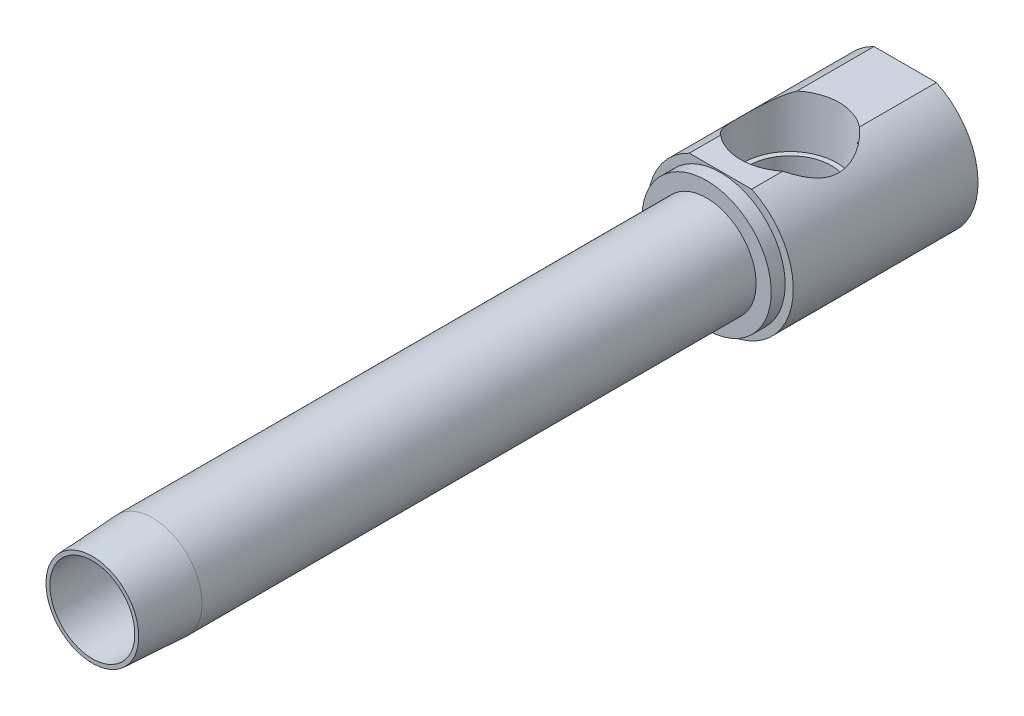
ISO-10303-21;
HEADER;
FILE_DESCRIPTION(('STEP AP214'),'2;1');
FILE_NAME('part.step','',(''),(''),'','','');
FILE_SCHEMA(('AUTOMOTIVE_DESIGN { 1 0 10303 214 1 1 1 1 }'));
ENDSEC;
DATA;
#1=APPLICATION_CONTEXT('core data for automotive mechanical design processes');
#2=APPLICATION_PROTOCOL_DEFINITION('international standard','automotive_design',2000,#1);
#3=PRODUCT_CONTEXT('',#1,'mechanical');
#4=PRODUCT('Part','Part','',(#3));
#5=PRODUCT_RELATED_PRODUCT_CATEGORY('part','',(#4));
#6=PRODUCT_DEFINITION_FORMATION('','',#4);
#7=PRODUCT_DEFINITION_CONTEXT('part definition',#1,'design');
#8=PRODUCT_DEFINITION('design','',#6,#7);
#9=PRODUCT_DEFINITION_SHAPE('','',#8);
#10=(LENGTH_UNIT() NAMED_UNIT(*) SI_UNIT(.MILLI.,.METRE.));
#11=(NAMED_UNIT(*) PLANE_ANGLE_UNIT() SI_UNIT($,.RADIAN.));
#12=(NAMED_UNIT(*) SI_UNIT($,.STERADIAN.) SOLID_ANGLE_UNIT());
#13=UNCERTAINTY_MEASURE_WITH_UNIT(LENGTH_MEASURE(1.E-05),#10,'distance_accuracy_value','');
#14=(GEOMETRIC_REPRESENTATION_CONTEXT(3) GLOBAL_UNCERTAINTY_ASSIGNED_CONTEXT((#13)) GLOBAL_UNIT_ASSIGNED_CONTEXT((#10,
#11,#12)) REPRESENTATION_CONTEXT('',''));
#15=CARTESIAN_POINT('',(0.,0.,0.));
#16=DIRECTION('',(0.,0.,1.));
#17=DIRECTION('',(1.,0.,0.));
#18=AXIS2_PLACEMENT_3D('',#15,#16,#17);
#19=CARTESIAN_POINT('',(-7.29488,0.,0.));
#20=DIRECTION('',(0.,0.,1.));
#21=DIRECTION('',(1.,0.,0.));
#22=AXIS2_PLACEMENT_3D('',#19,#20,#21);
#23=PLANE('',#22);
#24=CARTESIAN_POINT('',(0.,0.,0.));
#25=DIRECTION('',(0.,0.,-1.));
#26=DIRECTION('',(-1.,0.,0.));
#27=AXIS2_PLACEMENT_3D('',#24,#25,#26);
#28=CIRCLE('',#27,7.29488);
#29=CARTESIAN_POINT('',(-7.29488,0.,0.));
#30=VERTEX_POINT('',#29);
#31=EDGE_CURVE('E18',#30,#30,#28,.T.);
#32=ORIENTED_EDGE('',*,*,#31,.T.);
#33=EDGE_LOOP('',(#32));
#34=FACE_BOUND('',#33,.T.);
#35=CARTESIAN_POINT('',(0.,0.,0.));
#36=DIRECTION('',(0.,0.,-1.));
#37=DIRECTION('',(-1.,0.,0.));
#38=AXIS2_PLACEMENT_3D('',#35,#36,#37);
#39=CIRCLE('',#38,7.96721885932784);
#40=CARTESIAN_POINT('',(-7.96721885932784,0.,0.));
#41=VERTEX_POINT('',#40);
#42=EDGE_CURVE('E318',#41,#41,#39,.T.);
#43=ORIENTED_EDGE('',*,*,#42,.F.);
#44=EDGE_LOOP('',(#43));
#45=FACE_BOUND('',#44,.T.);
#46=ADVANCED_FACE('F15',(#34,#45),#23,.T.);
#47=CARTESIAN_POINT('',(0.,0.,-170.447166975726));
#48=DIRECTION('',(0.,0.,-1.));
#49=DIRECTION('',(-1.,0.,0.));
#50=AXIS2_PLACEMENT_3D('',#47,#48,#49);
#51=CYLINDRICAL_SURFACE('',#50,8.509);
#52=CARTESIAN_POINT('',(0.,0.,-10.3378));
#53=DIRECTION('',(0.,0.,-1.));
#54=DIRECTION('',(-1.,0.,0.));
#55=AXIS2_PLACEMENT_3D('',#52,#53,#54);
#56=CIRCLE('',#55,8.509);
#57=CARTESIAN_POINT('',(-8.509,0.,-10.3378));
#58=VERTEX_POINT('',#57);
#59=EDGE_CURVE('E320',#58,#58,#56,.T.);
#60=ORIENTED_EDGE('',*,*,#59,.T.);
#61=EDGE_LOOP('',(#60));
#62=FACE_BOUND('',#61,.T.);
#63=CARTESIAN_POINT('',(0.,0.,-105.5624));
#64=DIRECTION('',(0.,0.,-1.));
#65=DIRECTION('',(-1.,0.,0.));
#66=AXIS2_PLACEMENT_3D('',#63,#64,#65);
#67=CIRCLE('',#66,8.509);
#68=CARTESIAN_POINT('',(-8.509,0.,-105.5624));
#69=VERTEX_POINT('',#68);
#70=EDGE_CURVE('E152',#69,#69,#67,.T.);
#71=ORIENTED_EDGE('',*,*,#70,.F.);
#72=EDGE_LOOP('',(#71));
#73=FACE_BOUND('',#72,.T.);
#74=ADVANCED_FACE('F226',(#62,#73),#51,.T.);
#75=CARTESIAN_POINT('',(-5.3594,11.3032925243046,-95.25));
#76=DIRECTION('',(0.,-1.,0.));
#77=DIRECTION('',(0.,0.,-1.));
#78=AXIS2_PLACEMENT_3D('',#75,#76,#77);
#79=PLANE('',#78);
#80=DIRECTION('',(0.,0.,-1.));
#81=VECTOR('',#80,1.);
#82=CARTESIAN_POINT('',(5.3594,11.3032925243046,-95.25));
#83=LINE('',#82,#81);
#84=CARTESIAN_POINT('',(5.3594,11.3032925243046,-107.95));
#85=VERTEX_POINT('',#84);
#86=CARTESIAN_POINT('',(5.3594,11.3032925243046,-113.30323946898));
#87=VERTEX_POINT('',#86);
#88=EDGE_CURVE('E136',#85,#87,#83,.T.);
#89=ORIENTED_EDGE('',*,*,#88,.T.);
#90=CARTESIAN_POINT('',(0.,11.3032925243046,-119.888));
#91=DIRECTION('',(0.,-1.,0.));
#92=DIRECTION('',(0.,0.,-1.));
#93=AXIS2_PLACEMENT_3D('',#90,#91,#92);
#94=CIRCLE('',#93,8.49012600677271);
#95=CARTESIAN_POINT('',(-5.3594,11.3032925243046,-113.30323946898));
#96=VERTEX_POINT('',#95);
#97=EDGE_CURVE('E122',#87,#96,#94,.T.);
#98=ORIENTED_EDGE('',*,*,#97,.T.);
#99=DIRECTION('',(0.,0.,-1.));
#100=VECTOR('',#99,1.);
#101=CARTESIAN_POINT('',(-5.3594,11.3032925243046,-95.25));
#102=LINE('',#101,#100);
#103=CARTESIAN_POINT('',(-5.3594,11.3032925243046,-107.95));
#104=VERTEX_POINT('',#103);
#105=EDGE_CURVE('E147',#104,#96,#102,.T.);
#106=ORIENTED_EDGE('',*,*,#105,.F.);
#107=DIRECTION('',(1.,0.,0.));
#108=VECTOR('',#107,1.);
#109=CARTESIAN_POINT('',(-11.1125,11.3032925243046,-107.95));
#110=LINE('',#109,#108);
#111=EDGE_CURVE('E144',#104,#85,#110,.T.);
#112=ORIENTED_EDGE('',*,*,#111,.T.);
#113=EDGE_LOOP('',(#89,#98,#106,#112));
#114=FACE_BOUND('',#113,.T.);
#115=ADVANCED_FACE('F142',(#114),#79,.F.);
#116=CARTESIAN_POINT('',(0.,0.,-170.447166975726));
#117=DIRECTION('',(0.,0.,-1.));
#118=DIRECTION('',(-1.,0.,0.));
#119=AXIS2_PLACEMENT_3D('',#116,#117,#118);
#120=CYLINDRICAL_SURFACE('',#119,7.29488);
#121=ORIENTED_EDGE('',*,*,#31,.F.);
#122=EDGE_LOOP('',(#121));
#123=FACE_BOUND('',#122,.T.);
#124=CARTESIAN_POINT('',(0.,0.,-105.41));
#125=DIRECTION('',(0.,0.,-1.));
#126=DIRECTION('',(-1.,0.,0.));
#127=AXIS2_PLACEMENT_3D('',#124,#125,#126);
#128=CIRCLE('',#127,7.29488);
#129=CARTESIAN_POINT('',(-2.83926860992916,-6.71965981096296,-105.41));
#130=VERTEX_POINT('',#129);
#131=CARTESIAN_POINT('',(2.83926860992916,-6.71965981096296,-105.41));
#132=VERTEX_POINT('',#131);
#133=EDGE_CURVE('E166',#130,#132,#128,.T.);
#134=ORIENTED_EDGE('',*,*,#133,.T.);
#135=CARTESIAN_POINT('',(2.83926860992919,-6.71965981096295,-105.41));
#136=CARTESIAN_POINT('',(2.70908587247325,-6.77470567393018,-105.352021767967));
#137=CARTESIAN_POINT('',(2.57545350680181,-6.82667201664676,-105.298915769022));
#138=CARTESIAN_POINT('',(2.30236644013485,-6.92352687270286,-105.202164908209));
#139=CARTESIAN_POINT('',(2.16291320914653,-6.96841715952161,-105.158517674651));
#140=CARTESIAN_POINT('',(1.87942013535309,-7.05016472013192,-105.080434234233));
#141=CARTESIAN_POINT('',(1.7353879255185,-7.08703463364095,-105.045983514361));
#142=CARTESIAN_POINT('',(1.44358277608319,-7.1521803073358,-104.985918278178));
#143=CARTESIAN_POINT('',(1.2958096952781,-7.18045574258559,-104.96030409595));
#144=CARTESIAN_POINT('',(0.997667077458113,-7.22791200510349,-104.917692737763));
#145=CARTESIAN_POINT('',(0.847298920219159,-7.2470975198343,-104.900691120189));
#146=CARTESIAN_POINT('',(0.54494598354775,-7.27608226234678,-104.875120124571));
#147=CARTESIAN_POINT('',(0.392961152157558,-7.28588118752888,-104.86655101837));
#148=CARTESIAN_POINT('',(0.088339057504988,-7.29593786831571,-104.857757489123));
#149=CARTESIAN_POINT('',(-0.0642985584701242,-7.29618956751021,-104.857538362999));
#150=CARTESIAN_POINT('',(-0.369068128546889,-7.28713276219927,-104.865455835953));
#151=CARTESIAN_POINT('',(-0.521200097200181,-7.27782453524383,-104.873592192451));
#152=CARTESIAN_POINT('',(-0.825795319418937,-7.24962203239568,-104.898456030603));
#153=CARTESIAN_POINT('',(-0.978239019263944,-7.23060958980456,-104.915289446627));
#154=CARTESIAN_POINT('',(-1.28042184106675,-7.18325692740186,-104.957772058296));
#155=CARTESIAN_POINT('',(-1.43016107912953,-7.15491710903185,-104.983420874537));
#156=CARTESIAN_POINT('',(-1.72558403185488,-7.0894631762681,-105.043720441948));
#157=CARTESIAN_POINT('',(-1.87127414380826,-7.05236389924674,-105.078355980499));
#158=CARTESIAN_POINT('',(-2.15770494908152,-6.97006186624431,-105.156925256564));
#159=CARTESIAN_POINT('',(-2.29844851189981,-6.92486390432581,-105.200853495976));
#160=CARTESIAN_POINT('',(-2.50498218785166,-6.85169148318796,-105.273911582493));
#161=CARTESIAN_POINT('',(-2.57303323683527,-6.8264174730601,-105.299445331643));
#162=CARTESIAN_POINT('',(-2.70743134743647,-6.77423657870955,-105.352910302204));
#163=CARTESIAN_POINT('',(-2.77378053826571,-6.74733189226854,-105.380838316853));
#164=CARTESIAN_POINT('',(-2.83926860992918,-6.7196598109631,-105.41));
#165=B_SPLINE_CURVE_WITH_KNOTS('',3,(#135,#136,#137,#138,#139,#140,#141,#142,#143,#144,#145,
#146,#147,#148,#149,#150,#151,#152,#153,#154,#155,#156,#157,#158,#159,#160,#161,#162,#163,#164),
.UNSPECIFIED.,.F.,.F.,(4,2,2,2,2,2,2,2,2,2,2,2,2,2,4),(0.,0.458141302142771,0.91616759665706,
1.37346674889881,1.83078318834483,2.28786354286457,2.74495863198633,3.20234368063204,
3.65971545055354,4.12279436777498,4.58585335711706,5.04813354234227,5.51014097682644,
5.74093493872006,5.97142447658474),.UNSPECIFIED.);
#166=EDGE_CURVE('E228',#132,#130,#165,.T.);
#167=ORIENTED_EDGE('',*,*,#166,.T.);
#168=EDGE_LOOP('',(#134,#167));
#169=FACE_BOUND('',#168,.T.);
#170=ADVANCED_FACE('F221',(#123,#169),#120,.F.);
#171=CARTESIAN_POINT('',(-7.29488,0.,-105.41));
#172=DIRECTION('',(0.,0.,1.));
#173=DIRECTION('',(1.,0.,0.));
#174=AXIS2_PLACEMENT_3D('',#171,#172,#173);
#175=PLANE('',#174);
#176=ORIENTED_EDGE('',*,*,#133,.F.);
#177=CARTESIAN_POINT('',(0.,-0.996470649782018,-105.41));
#178=DIRECTION('',(0.,0.,1.));
#179=DIRECTION('',(0.,-1.,0.));
#180=AXIS2_PLACEMENT_3D('',#177,#178,#179);
#181=ELLIPSE('',#180,6.41876281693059,6.27107494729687);
#182=EDGE_CURVE('E170',#130,#132,#181,.F.);
#183=ORIENTED_EDGE('',*,*,#182,.T.);
#184=EDGE_LOOP('',(#176,#183));
#185=FACE_BOUND('',#184,.T.);
#186=ADVANCED_FACE('F217',(#185),#175,.T.);
#187=CARTESIAN_POINT('',(-12.5095,0.,-139.7));
#188=DIRECTION('',(0.,0.,-1.));
#189=DIRECTION('',(-1.,0.,0.));
#190=AXIS2_PLACEMENT_3D('',#187,#188,#189);
#191=PLANE('',#190);
#192=DIRECTION('',(1.,0.,0.));
#193=VECTOR('',#192,1.);
#194=CARTESIAN_POINT('',(-3.66617420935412,6.35,-139.7));
#195=LINE('',#194,#193);
#196=CARTESIAN_POINT('',(-3.66617420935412,6.35,-139.7));
#197=VERTEX_POINT('',#196);
#198=CARTESIAN_POINT('',(3.66617420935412,6.35,-139.7));
#199=VERTEX_POINT('',#198);
#200=EDGE_CURVE('E235',#197,#199,#195,.T.);
#201=ORIENTED_EDGE('',*,*,#200,.F.);
#202=DIRECTION('',(0.5,0.866025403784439,0.));
#203=VECTOR('',#202,1.);
#204=CARTESIAN_POINT('',(-7.33234841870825,0.,-139.7));
#205=LINE('',#204,#203);
#206=CARTESIAN_POINT('',(-7.33234841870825,0.,-139.7));
#207=VERTEX_POINT('',#206);
#208=EDGE_CURVE('E242',#207,#197,#205,.T.);
#209=ORIENTED_EDGE('',*,*,#208,.F.);
#210=DIRECTION('',(-0.5,0.866025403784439,0.));
#211=VECTOR('',#210,1.);
#212=CARTESIAN_POINT('',(-3.66617420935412,-6.35,-139.7));
#213=LINE('',#212,#211);
#214=CARTESIAN_POINT('',(-3.66617420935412,-6.35,-139.7));
#215=VERTEX_POINT('',#214);
#216=EDGE_CURVE('E268',#215,#207,#213,.T.);
#217=ORIENTED_EDGE('',*,*,#216,.F.);
#218=DIRECTION('',(-1.,0.,0.));
#219=VECTOR('',#218,1.);
#220=CARTESIAN_POINT('',(3.66617420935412,-6.35,-139.7));
#221=LINE('',#220,#219);
#222=CARTESIAN_POINT('',(3.66617420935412,-6.35,-139.7));
#223=VERTEX_POINT('',#222);
#224=EDGE_CURVE('E265',#223,#215,#221,.T.);
#225=ORIENTED_EDGE('',*,*,#224,.F.);
#226=DIRECTION('',(-0.5,-0.866025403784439,0.));
#227=VECTOR('',#226,1.);
#228=CARTESIAN_POINT('',(7.33234841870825,0.,-139.7));
#229=LINE('',#228,#227);
#230=CARTESIAN_POINT('',(7.33234841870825,0.,-139.7));
#231=VERTEX_POINT('',#230);
#232=EDGE_CURVE('E262',#231,#223,#229,.T.);
#233=ORIENTED_EDGE('',*,*,#232,.F.);
#234=DIRECTION('',(0.5,-0.866025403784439,0.));
#235=VECTOR('',#234,1.);
#236=CARTESIAN_POINT('',(3.66617420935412,6.35,-139.7));
#237=LINE('',#236,#235);
#238=EDGE_CURVE('E259',#199,#231,#237,.T.);
#239=ORIENTED_EDGE('',*,*,#238,.F.);
#240=EDGE_LOOP('',(#201,#209,#217,#225,#233,#239));
#241=FACE_BOUND('',#240,.T.);
#242=DIRECTION('',(-1.,0.,0.));
#243=VECTOR('',#242,1.);
#244=CARTESIAN_POINT('',(-5.3594,11.3032925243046,-139.7));
#245=LINE('',#244,#243);
#246=CARTESIAN_POINT('',(5.3594,11.3032925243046,-139.7));
#247=VERTEX_POINT('',#246);
#248=CARTESIAN_POINT('',(-5.3594,11.3032925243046,-139.7));
#249=VERTEX_POINT('',#248);
#250=EDGE_CURVE('E149',#247,#249,#245,.T.);
#251=ORIENTED_EDGE('',*,*,#250,.F.);
#252=CARTESIAN_POINT('',(0.,0.,-139.7));
#253=DIRECTION('',(0.,0.,-1.));
#254=DIRECTION('',(-1.,0.,0.));
#255=AXIS2_PLACEMENT_3D('',#252,#253,#254);
#256=CIRCLE('',#255,12.5095);
#257=EDGE_CURVE('E163',#247,#249,#256,.T.);
#258=ORIENTED_EDGE('',*,*,#257,.T.);
#259=EDGE_LOOP('',(#251,#258));
#260=FACE_BOUND('',#259,.T.);
#261=ADVANCED_FACE('F212',(#241,#260),#191,.T.);
#262=CARTESIAN_POINT('',(0.,0.,-170.447166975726));
#263=DIRECTION('',(0.,0.,-1.));
#264=DIRECTION('',(-1.,0.,0.));
#265=AXIS2_PLACEMENT_3D('',#262,#263,#264);
#266=CYLINDRICAL_SURFACE('',#265,12.5095);
#267=CARTESIAN_POINT('',(5.3589781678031,11.3034925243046,-113.302882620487));
#268=CARTESIAN_POINT('',(5.5492136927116,11.2133234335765,-113.463840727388));
#269=CARTESIAN_POINT('',(5.73165431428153,11.1209258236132,-113.632665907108));
#270=CARTESIAN_POINT('',(6.08048620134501,10.9340894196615,-113.985220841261));
#271=CARTESIAN_POINT('',(6.24687354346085,10.8396501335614,-114.16895421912));
#272=CARTESIAN_POINT('',(6.56420314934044,10.6505028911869,-114.551812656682));
#273=CARTESIAN_POINT('',(6.71502345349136,10.5557980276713,-114.751040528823));
#274=CARTESIAN_POINT('',(6.99914257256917,10.3695935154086,-115.162863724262));
#275=CARTESIAN_POINT('',(7.1324444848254,10.2780933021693,-115.375456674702));
#276=CARTESIAN_POINT('',(7.46650834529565,10.0401700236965,-115.964674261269));
#277=CARTESIAN_POINT('',(7.65054804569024,9.89929381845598,-116.353481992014));
#278=CARTESIAN_POINT('',(7.88323238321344,9.71350267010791,-116.959963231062));
#279=CARTESIAN_POINT('',(7.9535071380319,9.65587918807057,-117.165745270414));
#280=CARTESIAN_POINT('',(8.07900681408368,9.55112103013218,-117.584515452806));
#281=CARTESIAN_POINT('',(8.1342346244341,9.50398434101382,-117.797502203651));
#282=CARTESIAN_POINT('',(8.22106638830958,9.42891275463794,-118.194107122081));
#283=CARTESIAN_POINT('',(8.25505388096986,9.39910020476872,-118.376852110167));
#284=CARTESIAN_POINT('',(8.31144289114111,9.34927427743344,-118.745430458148));
#285=CARTESIAN_POINT('',(8.33384667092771,9.32925898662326,-118.931263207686));
#286=CARTESIAN_POINT('',(8.36672861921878,9.29978140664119,-119.304727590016));
#287=CARTESIAN_POINT('',(8.37721265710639,9.29031392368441,-119.49235829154));
#288=CARTESIAN_POINT('',(8.3861052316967,9.28228778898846,-119.868146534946));
#289=CARTESIAN_POINT('',(8.38451351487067,9.28372936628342,-120.056304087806));
#290=CARTESIAN_POINT('',(8.36928475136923,9.29746017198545,-120.431613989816));
#291=CARTESIAN_POINT('',(8.35565497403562,9.30974285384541,-120.61876687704));
#292=CARTESIAN_POINT('',(8.31657917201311,9.3446659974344,-120.990843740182));
#293=CARTESIAN_POINT('',(8.2911332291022,9.36730638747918,-121.175767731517));
#294=CARTESIAN_POINT('',(8.22876601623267,9.42213985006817,-121.542394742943));
#295=CARTESIAN_POINT('',(8.19183425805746,9.45434165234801,-121.724094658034));
#296=CARTESIAN_POINT('',(8.10694730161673,9.52723048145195,-122.083247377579));
#297=CARTESIAN_POINT('',(8.0589858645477,9.56792230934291,-122.26069771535));
#298=CARTESIAN_POINT('',(7.93720028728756,9.66935365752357,-122.660957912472));
#299=CARTESIAN_POINT('',(7.85990590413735,9.73249157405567,-122.882109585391));
#300=CARTESIAN_POINT('',(7.68886075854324,9.86817719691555,-123.314976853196));
#301=CARTESIAN_POINT('',(7.59510436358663,9.94072812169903,-123.526689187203));
#302=CARTESIAN_POINT('',(7.39186656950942,10.092770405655,-123.940230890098));
#303=CARTESIAN_POINT('',(7.28236248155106,10.172271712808,-124.142045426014));
#304=CARTESIAN_POINT('',(7.04849385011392,10.3357003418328,-124.534850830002));
#305=CARTESIAN_POINT('',(6.92413202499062,10.4196268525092,-124.7258436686));
#306=CARTESIAN_POINT('',(6.58695562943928,10.637641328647,-125.201021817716));
#307=CARTESIAN_POINT('',(6.36373226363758,10.7733928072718,-125.477203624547));
#308=CARTESIAN_POINT('',(6.00459360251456,10.9750283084,-125.868460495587));
#309=CARTESIAN_POINT('',(5.88113847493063,11.0417585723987,-125.994781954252));
#310=CARTESIAN_POINT('',(5.62611191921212,11.1738564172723,-126.239769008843));
#311=CARTESIAN_POINT('',(5.49453878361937,11.2392237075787,-126.358432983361));
#312=CARTESIAN_POINT('',(5.3589781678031,11.3034925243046,-126.473117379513));
#313=B_SPLINE_CURVE_WITH_KNOTS('',3,(#267,#268,#269,#270,#271,#272,#273,#274,#275,#276,#277,
#278,#279,#280,#281,#282,#283,#284,#285,#286,#287,#288,#289,#290,#291,#292,#293,#294,#295,#296,
#297,#298,#299,#300,#301,#302,#303,#304,#305,#306,#307,#308,#309,#310,#311,#312),.UNSPECIFIED.,
.F.,.F.,(4,2,2,2,2,2,2,2,2,2,2,2,2,2,2,2,2,2,2,2,2,2,4),(0.,0.794684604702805,1.58956293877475,
2.39025916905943,3.19081364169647,4.54240556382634,5.21661127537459,5.89068744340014,
6.45486541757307,7.01893316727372,7.58272304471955,8.14652475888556,8.70998624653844,
9.2734438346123,9.83741745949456,10.4017108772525,11.128553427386,11.8556451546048,
12.5837951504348,13.3118121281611,14.449296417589,15.0154674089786,15.5817578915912),.UNSPECIFIED.);
#314=CARTESIAN_POINT('',(5.3594,11.3032925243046,-126.47276053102));
#315=VERTEX_POINT('',#314);
#316=EDGE_CURVE('E30',#87,#315,#313,.T.);
#317=ORIENTED_EDGE('',*,*,#316,.F.);
#318=ORIENTED_EDGE('',*,*,#88,.F.);
#319=CARTESIAN_POINT('',(0.,0.,-107.95));
#320=DIRECTION('',(0.,0.,-1.));
#321=DIRECTION('',(-1.,0.,0.));
#322=AXIS2_PLACEMENT_3D('',#319,#320,#321);
#323=CIRCLE('',#322,12.5095);
#324=EDGE_CURVE('E161',#85,#104,#323,.T.);
#325=ORIENTED_EDGE('',*,*,#324,.T.);
#326=ORIENTED_EDGE('',*,*,#105,.T.);
#327=CARTESIAN_POINT('',(-5.3589781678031,11.3034925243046,-126.473117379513));
#328=CARTESIAN_POINT('',(-5.54921369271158,11.2133234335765,-126.312159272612));
#329=CARTESIAN_POINT('',(-5.73165431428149,11.1209258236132,-126.143334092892));
#330=CARTESIAN_POINT('',(-6.08048620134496,10.9340894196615,-125.790779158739));
#331=CARTESIAN_POINT('',(-6.2468735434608,10.8396501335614,-125.60704578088));
#332=CARTESIAN_POINT('',(-6.56420314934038,10.650502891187,-125.224187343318));
#333=CARTESIAN_POINT('',(-6.71502345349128,10.5557980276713,-125.024959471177));
#334=CARTESIAN_POINT('',(-6.99914257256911,10.3695935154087,-124.613136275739));
#335=CARTESIAN_POINT('',(-7.13244448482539,10.2780933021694,-124.400543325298));
#336=CARTESIAN_POINT('',(-7.4665083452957,10.0401700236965,-123.811325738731));
#337=CARTESIAN_POINT('',(-7.65054804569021,9.89929381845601,-123.422518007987));
#338=CARTESIAN_POINT('',(-7.88323238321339,9.71350267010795,-122.816036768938));
#339=CARTESIAN_POINT('',(-7.95350713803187,9.6558791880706,-122.610254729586));
#340=CARTESIAN_POINT('',(-8.07900681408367,9.55112103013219,-122.191484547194));
#341=CARTESIAN_POINT('',(-8.1342346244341,9.50398434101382,-121.978497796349));
#342=CARTESIAN_POINT('',(-8.22106638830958,9.42891275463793,-121.581892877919));
#343=CARTESIAN_POINT('',(-8.25505388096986,9.39910020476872,-121.399147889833));
#344=CARTESIAN_POINT('',(-8.31144289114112,9.34927427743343,-121.030569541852));
#345=CARTESIAN_POINT('',(-8.33384667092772,9.32925898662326,-120.844736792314));
#346=CARTESIAN_POINT('',(-8.36672861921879,9.29978140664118,-120.471272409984));
#347=CARTESIAN_POINT('',(-8.37721265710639,9.29031392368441,-120.28364170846));
#348=CARTESIAN_POINT('',(-8.3861052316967,9.28228778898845,-119.907853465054));
#349=CARTESIAN_POINT('',(-8.38451351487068,9.28372936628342,-119.719695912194));
#350=CARTESIAN_POINT('',(-8.36928475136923,9.29746017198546,-119.344386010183));
#351=CARTESIAN_POINT('',(-8.35565497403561,9.30974285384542,-119.15723312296));
#352=CARTESIAN_POINT('',(-8.31657917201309,9.34466599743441,-118.785156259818));
#353=CARTESIAN_POINT('',(-8.29113322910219,9.36730638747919,-118.600232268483));
#354=CARTESIAN_POINT('',(-8.22876601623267,9.42213985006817,-118.233605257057));
#355=CARTESIAN_POINT('',(-8.19183425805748,9.45434165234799,-118.051905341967));
#356=CARTESIAN_POINT('',(-8.10694730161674,9.52723048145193,-117.692752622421));
#357=CARTESIAN_POINT('',(-8.05898586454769,9.56792230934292,-117.51530228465));
#358=CARTESIAN_POINT('',(-7.93720028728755,9.66935365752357,-117.115042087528));
#359=CARTESIAN_POINT('',(-7.85990590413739,9.73249157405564,-116.89389041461));
#360=CARTESIAN_POINT('',(-7.6888607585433,9.8681771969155,-116.461023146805));
#361=CARTESIAN_POINT('',(-7.59510436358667,9.94072812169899,-116.249310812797));
#362=CARTESIAN_POINT('',(-7.39186656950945,10.0927704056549,-115.835769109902));
#363=CARTESIAN_POINT('',(-7.28236248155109,10.172271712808,-115.633954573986));
#364=CARTESIAN_POINT('',(-7.04849385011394,10.3357003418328,-115.241149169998));
#365=CARTESIAN_POINT('',(-6.92413202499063,10.4196268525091,-115.0501563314));
#366=CARTESIAN_POINT('',(-6.58695562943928,10.637641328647,-114.574978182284));
#367=CARTESIAN_POINT('',(-6.36373226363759,10.7733928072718,-114.298796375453));
#368=CARTESIAN_POINT('',(-6.00459360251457,10.9750283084,-113.907539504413));
#369=CARTESIAN_POINT('',(-5.88113847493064,11.0417585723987,-113.781218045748));
#370=CARTESIAN_POINT('',(-5.62611191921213,11.1738564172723,-113.536230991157));
#371=CARTESIAN_POINT('',(-5.49453878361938,11.2392237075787,-113.417567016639));
#372=CARTESIAN_POINT('',(-5.3589781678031,11.3034925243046,-113.302882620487));
#373=B_SPLINE_CURVE_WITH_KNOTS('',3,(#327,#328,#329,#330,#331,#332,#333,#334,#335,#336,#337,
#338,#339,#340,#341,#342,#343,#344,#345,#346,#347,#348,#349,#350,#351,#352,#353,#354,#355,#356,
#357,#358,#359,#360,#361,#362,#363,#364,#365,#366,#367,#368,#369,#370,#371,#372),.UNSPECIFIED.,
.F.,.F.,(4,2,2,2,2,2,2,2,2,2,2,2,2,2,2,2,2,2,2,2,2,2,4),(0.,0.794684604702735,1.58956293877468,
2.39025916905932,3.1908136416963,4.54240556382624,5.21661127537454,5.89068744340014,
6.45486541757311,7.01893316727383,7.5827230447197,8.14652475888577,8.70998624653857,
9.27344383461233,9.83741745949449,10.4017108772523,11.1285534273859,11.8556451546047,
12.5837951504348,13.3118121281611,14.449296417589,15.0154674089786,15.5817578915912),.UNSPECIFIED.);
#374=CARTESIAN_POINT('',(-5.3594,11.3032925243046,-126.47276053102));
#375=VERTEX_POINT('',#374);
#376=EDGE_CURVE('E125',#375,#96,#373,.T.);
#377=ORIENTED_EDGE('',*,*,#376,.F.);
#378=EDGE_CURVE('E145',#375,#249,#102,.T.);
#379=ORIENTED_EDGE('',*,*,#378,.T.);
#380=ORIENTED_EDGE('',*,*,#257,.F.);
#381=EDGE_CURVE('E139',#315,#247,#83,.T.);
#382=ORIENTED_EDGE('',*,*,#381,.F.);
#383=EDGE_LOOP('',(#317,#318,#325,#326,#377,#379,#380,#382));
#384=FACE_BOUND('',#383,.T.);
#385=ADVANCED_FACE('F134',(#384),#266,.T.);
#386=CARTESIAN_POINT('',(-11.1125,0.,-107.95));
#387=DIRECTION('',(0.,0.,1.));
#388=DIRECTION('',(1.,0.,0.));
#389=AXIS2_PLACEMENT_3D('',#386,#387,#388);
#390=PLANE('',#389);
#391=ORIENTED_EDGE('',*,*,#111,.F.);
#392=ORIENTED_EDGE('',*,*,#324,.F.);
#393=EDGE_LOOP('',(#391,#392));
#394=FACE_BOUND('',#393,.T.);
#395=CARTESIAN_POINT('',(0.,0.,-107.95));
#396=DIRECTION('',(0.,0.,-1.));
#397=DIRECTION('',(-1.,0.,0.));
#398=AXIS2_PLACEMENT_3D('',#395,#396,#397);
#399=CIRCLE('',#398,11.1125);
#400=CARTESIAN_POINT('',(-11.1125,0.,-107.95));
#401=VERTEX_POINT('',#400);
#402=EDGE_CURVE('E158',#401,#401,#399,.T.);
#403=ORIENTED_EDGE('',*,*,#402,.T.);
#404=EDGE_LOOP('',(#403));
#405=FACE_BOUND('',#404,.T.);
#406=ADVANCED_FACE('F211',(#394,#405),#390,.T.);
#407=CARTESIAN_POINT('',(0.,0.,-170.447166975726));
#408=DIRECTION('',(0.,0.,-1.));
#409=DIRECTION('',(-1.,0.,0.));
#410=AXIS2_PLACEMENT_3D('',#407,#408,#409);
#411=CYLINDRICAL_SURFACE('',#410,11.1125);
#412=CARTESIAN_POINT('',(0.,0.,-105.5624));
#413=DIRECTION('',(0.,0.,-1.));
#414=DIRECTION('',(-1.,0.,0.));
#415=AXIS2_PLACEMENT_3D('',#412,#413,#414);
#416=CIRCLE('',#415,11.1125);
#417=CARTESIAN_POINT('',(-11.1125,0.,-105.5624));
#418=VERTEX_POINT('',#417);
#419=EDGE_CURVE('E155',#418,#418,#416,.T.);
#420=ORIENTED_EDGE('',*,*,#419,.T.);
#421=EDGE_LOOP('',(#420));
#422=FACE_BOUND('',#421,.T.);
#423=ORIENTED_EDGE('',*,*,#402,.F.);
#424=EDGE_LOOP('',(#423));
#425=FACE_BOUND('',#424,.T.);
#426=ADVANCED_FACE('F293',(#422,#425),#411,.T.);
#427=CARTESIAN_POINT('',(-8.509,0.,-105.5624));
#428=DIRECTION('',(0.,0.,1.));
#429=DIRECTION('',(1.,0.,0.));
#430=AXIS2_PLACEMENT_3D('',#427,#428,#429);
#431=PLANE('',#430);
#432=ORIENTED_EDGE('',*,*,#70,.T.);
#433=EDGE_LOOP('',(#432));
#434=FACE_BOUND('',#433,.T.);
#435=ORIENTED_EDGE('',*,*,#419,.F.);
#436=EDGE_LOOP('',(#435));
#437=FACE_BOUND('',#436,.T.);
#438=ADVANCED_FACE('F297',(#434,#437),#431,.T.);
#439=ORIENTED_EDGE('',*,*,#378,.F.);
#440=EDGE_CURVE('E129',#375,#315,#94,.T.);
#441=ORIENTED_EDGE('',*,*,#440,.T.);
#442=ORIENTED_EDGE('',*,*,#381,.T.);
#443=ORIENTED_EDGE('',*,*,#250,.T.);
#444=EDGE_LOOP('',(#439,#441,#442,#443));
#445=FACE_BOUND('',#444,.T.);
#446=ADVANCED_FACE('F288',(#445),#79,.F.);
#447=CARTESIAN_POINT('',(-3.66617420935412,6.35,-133.35));
#448=DIRECTION('',(0.,1.,0.));
#449=DIRECTION('',(-1.,0.,0.));
#450=AXIS2_PLACEMENT_3D('',#447,#448,#449);
#451=PLANE('',#450);
#452=ORIENTED_EDGE('',*,*,#200,.T.);
#453=DIRECTION('',(0.,0.,-1.));
#454=VECTOR('',#453,1.);
#455=CARTESIAN_POINT('',(3.66617420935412,6.35,-133.35));
#456=LINE('',#455,#454);
#457=CARTESIAN_POINT('',(3.66617420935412,6.35,-133.35));
#458=VERTEX_POINT('',#457);
#459=EDGE_CURVE('E257',#458,#199,#456,.T.);
#460=ORIENTED_EDGE('',*,*,#459,.F.);
#461=DIRECTION('',(1.,0.,0.));
#462=VECTOR('',#461,1.);
#463=CARTESIAN_POINT('',(-3.66617420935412,6.35,-133.35));
#464=LINE('',#463,#462);
#465=CARTESIAN_POINT('',(-3.66617420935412,6.35,-133.35));
#466=VERTEX_POINT('',#465);
#467=EDGE_CURVE('E238',#466,#458,#464,.T.);
#468=ORIENTED_EDGE('',*,*,#467,.F.);
#469=DIRECTION('',(0.,0.,-1.));
#470=VECTOR('',#469,1.);
#471=CARTESIAN_POINT('',(-3.66617420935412,6.35,-133.35));
#472=LINE('',#471,#470);
#473=EDGE_CURVE('E273',#466,#197,#472,.T.);
#474=ORIENTED_EDGE('',*,*,#473,.T.);
#475=EDGE_LOOP('',(#452,#460,#468,#474));
#476=FACE_BOUND('',#475,.T.);
#477=ADVANCED_FACE('F392',(#476),#451,.F.);
#478=CARTESIAN_POINT('',(-7.33234841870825,0.,-133.35));
#479=DIRECTION('',(-0.866025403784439,0.5,0.));
#480=DIRECTION('',(-0.5,-0.866025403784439,0.));
#481=AXIS2_PLACEMENT_3D('',#478,#479,#480);
#482=PLANE('',#481);
#483=ORIENTED_EDGE('',*,*,#208,.T.);
#484=ORIENTED_EDGE('',*,*,#473,.F.);
#485=DIRECTION('',(0.5,0.866025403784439,0.));
#486=VECTOR('',#485,1.);
#487=CARTESIAN_POINT('',(-7.33234841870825,0.,-133.35));
#488=LINE('',#487,#486);
#489=CARTESIAN_POINT('',(-7.33234841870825,0.,-133.35));
#490=VERTEX_POINT('',#489);
#491=EDGE_CURVE('E254',#490,#466,#488,.T.);
#492=ORIENTED_EDGE('',*,*,#491,.F.);
#493=DIRECTION('',(0.,0.,-1.));
#494=VECTOR('',#493,1.);
#495=CARTESIAN_POINT('',(-7.33234841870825,0.,-133.35));
#496=LINE('',#495,#494);
#497=EDGE_CURVE('E275',#490,#207,#496,.T.);
#498=ORIENTED_EDGE('',*,*,#497,.T.);
#499=EDGE_LOOP('',(#483,#484,#492,#498));
#500=FACE_BOUND('',#499,.T.);
#501=ADVANCED_FACE('F388',(#500),#482,.F.);
#502=CARTESIAN_POINT('',(-3.66617420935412,-6.35,-133.35));
#503=DIRECTION('',(-0.866025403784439,-0.5,0.));
#504=DIRECTION('',(0.5,-0.866025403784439,0.));
#505=AXIS2_PLACEMENT_3D('',#502,#503,#504);
#506=PLANE('',#505);
#507=ORIENTED_EDGE('',*,*,#216,.T.);
#508=ORIENTED_EDGE('',*,*,#497,.F.);
#509=DIRECTION('',(-0.5,0.866025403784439,0.));
#510=VECTOR('',#509,1.);
#511=CARTESIAN_POINT('',(-3.66617420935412,-6.35,-133.35));
#512=LINE('',#511,#510);
#513=CARTESIAN_POINT('',(-3.66617420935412,-6.35,-133.35));
#514=VERTEX_POINT('',#513);
#515=EDGE_CURVE('E251',#514,#490,#512,.T.);
#516=ORIENTED_EDGE('',*,*,#515,.F.);
#517=DIRECTION('',(0.,0.,-1.));
#518=VECTOR('',#517,1.);
#519=CARTESIAN_POINT('',(-3.66617420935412,-6.35,-133.35));
#520=LINE('',#519,#518);
#521=EDGE_CURVE('E277',#514,#215,#520,.T.);
#522=ORIENTED_EDGE('',*,*,#521,.T.);
#523=EDGE_LOOP('',(#507,#508,#516,#522));
#524=FACE_BOUND('',#523,.T.);
#525=ADVANCED_FACE('F391',(#524),#506,.F.);
#526=CARTESIAN_POINT('',(3.66617420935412,-6.35,-133.35));
#527=DIRECTION('',(0.,-1.,0.));
#528=DIRECTION('',(1.,0.,0.));
#529=AXIS2_PLACEMENT_3D('',#526,#527,#528);
#530=PLANE('',#529);
#531=ORIENTED_EDGE('',*,*,#224,.T.);
#532=ORIENTED_EDGE('',*,*,#521,.F.);
#533=DIRECTION('',(-1.,0.,0.));
#534=VECTOR('',#533,1.);
#535=CARTESIAN_POINT('',(3.66617420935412,-6.35,-133.35));
#536=LINE('',#535,#534);
#537=CARTESIAN_POINT('',(3.66617420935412,-6.35,-133.35));
#538=VERTEX_POINT('',#537);
#539=EDGE_CURVE('E248',#538,#514,#536,.T.);
#540=ORIENTED_EDGE('',*,*,#539,.F.);
#541=DIRECTION('',(0.,0.,-1.));
#542=VECTOR('',#541,1.);
#543=CARTESIAN_POINT('',(3.66617420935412,-6.35,-133.35));
#544=LINE('',#543,#542);
#545=EDGE_CURVE('E279',#538,#223,#544,.T.);
#546=ORIENTED_EDGE('',*,*,#545,.T.);
#547=EDGE_LOOP('',(#531,#532,#540,#546));
#548=FACE_BOUND('',#547,.T.);
#549=ADVANCED_FACE('F396',(#548),#530,.F.);
#550=CARTESIAN_POINT('',(7.33234841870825,0.,-133.35));
#551=DIRECTION('',(0.866025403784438,-0.5,0.));
#552=DIRECTION('',(0.5,0.866025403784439,0.));
#553=AXIS2_PLACEMENT_3D('',#550,#551,#552);
#554=PLANE('',#553);
#555=ORIENTED_EDGE('',*,*,#232,.T.);
#556=ORIENTED_EDGE('',*,*,#545,.F.);
#557=DIRECTION('',(-0.5,-0.866025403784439,0.));
#558=VECTOR('',#557,1.);
#559=CARTESIAN_POINT('',(7.33234841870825,0.,-133.35));
#560=LINE('',#559,#558);
#561=CARTESIAN_POINT('',(7.33234841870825,0.,-133.35));
#562=VERTEX_POINT('',#561);
#563=EDGE_CURVE('E245',#562,#538,#560,.T.);
#564=ORIENTED_EDGE('',*,*,#563,.F.);
#565=DIRECTION('',(0.,0.,-1.));
#566=VECTOR('',#565,1.);
#567=CARTESIAN_POINT('',(7.33234841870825,0.,-133.35));
#568=LINE('',#567,#566);
#569=EDGE_CURVE('E281',#562,#231,#568,.T.);
#570=ORIENTED_EDGE('',*,*,#569,.T.);
#571=EDGE_LOOP('',(#555,#556,#564,#570));
#572=FACE_BOUND('',#571,.T.);
#573=ADVANCED_FACE('F400',(#572),#554,.F.);
#574=CARTESIAN_POINT('',(3.66617420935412,6.35,-133.35));
#575=DIRECTION('',(0.866025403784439,0.5,0.));
#576=DIRECTION('',(-0.5,0.866025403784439,0.));
#577=AXIS2_PLACEMENT_3D('',#574,#575,#576);
#578=PLANE('',#577);
#579=ORIENTED_EDGE('',*,*,#238,.T.);
#580=ORIENTED_EDGE('',*,*,#569,.F.);
#581=DIRECTION('',(0.5,-0.866025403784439,0.));
#582=VECTOR('',#581,1.);
#583=CARTESIAN_POINT('',(3.66617420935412,6.35,-133.35));
#584=LINE('',#583,#582);
#585=EDGE_CURVE('E241',#458,#562,#584,.T.);
#586=ORIENTED_EDGE('',*,*,#585,.F.);
#587=ORIENTED_EDGE('',*,*,#459,.T.);
#588=EDGE_LOOP('',(#579,#580,#586,#587));
#589=FACE_BOUND('',#588,.T.);
#590=ADVANCED_FACE('F386',(#589),#578,.F.);
#591=CARTESIAN_POINT('',(0.,0.,-133.35));
#592=DIRECTION('',(0.,0.,-1.));
#593=DIRECTION('',(-1.,0.,0.));
#594=AXIS2_PLACEMENT_3D('',#591,#592,#593);
#595=PLANE('',#594);
#596=ORIENTED_EDGE('',*,*,#467,.T.);
#597=ORIENTED_EDGE('',*,*,#585,.T.);
#598=ORIENTED_EDGE('',*,*,#563,.T.);
#599=ORIENTED_EDGE('',*,*,#539,.T.);
#600=ORIENTED_EDGE('',*,*,#515,.T.);
#601=ORIENTED_EDGE('',*,*,#491,.T.);
#602=EDGE_LOOP('',(#596,#597,#598,#599,#600,#601));
#603=FACE_BOUND('',#602,.T.);
#604=ADVANCED_FACE('F381',(#603),#595,.T.);
#605=CARTESIAN_POINT('',(0.,-4.02688128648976,-119.291711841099));
#606=DIRECTION('',(0.,0.213279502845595,0.976991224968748));
#607=DIRECTION('',(0.,-0.976991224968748,0.213279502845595));
#608=AXIS2_PLACEMENT_3D('',#605,#606,#607);
#609=CONICAL_SURFACE('',#608,6.27107494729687,0.738529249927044);
#610=CARTESIAN_POINT('',(0.,-7.8171617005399,-122.001165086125));
#611=CARTESIAN_POINT('',(0.0306488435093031,-7.81716198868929,-122.001165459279));
#612=CARTESIAN_POINT('',(0.0612977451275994,-7.81694149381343,-122.000879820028));
#613=CARTESIAN_POINT('',(0.129766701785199,-7.81595747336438,-121.999605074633));
#614=CARTESIAN_POINT('',(0.16758240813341,-7.81507869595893,-121.998466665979));
#615=CARTESIAN_POINT('',(0.243722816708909,-7.81263621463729,-121.995302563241));
#616=CARTESIAN_POINT('',(0.28204666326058,-7.81106245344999,-121.993263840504));
#617=CARTESIAN_POINT('',(0.338345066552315,-7.80824831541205,-121.989618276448));
#618=CARTESIAN_POINT('',(0.356356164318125,-7.80727222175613,-121.988353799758));
#619=CARTESIAN_POINT('',(0.446379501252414,-7.8020163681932,-121.981545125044));
#620=CARTESIAN_POINT('',(0.518221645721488,-7.79661392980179,-121.974546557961));
#621=CARTESIAN_POINT('',(0.733733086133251,-7.77685263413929,-121.948946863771));
#622=CARTESIAN_POINT('',(0.87656324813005,-7.75896145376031,-121.92576979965));
#623=CARTESIAN_POINT('',(1.15867598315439,-7.71482779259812,-121.868597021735));
#624=CARTESIAN_POINT('',(1.29795748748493,-7.68858282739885,-121.834598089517));
#625=CARTESIAN_POINT('',(1.6188631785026,-7.6188762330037,-121.744296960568));
#626=CARTESIAN_POINT('',(1.79884032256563,-7.57259419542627,-121.684341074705));
#627=CARTESIAN_POINT('',(2.15114857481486,-7.47011058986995,-121.551579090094));
#628=CARTESIAN_POINT('',(2.32347015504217,-7.41389707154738,-121.478757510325));
#629=CARTESIAN_POINT('',(2.66304496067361,-7.29317142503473,-121.322363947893));
#630=CARTESIAN_POINT('',(2.8302045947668,-7.22856193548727,-121.238665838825));
#631=CARTESIAN_POINT('',(3.07597005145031,-7.12727098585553,-121.107448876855));
#632=CARTESIAN_POINT('',(3.15704408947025,-7.09278664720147,-121.062776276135));
#633=CARTESIAN_POINT('',(3.31767893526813,-7.02252656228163,-120.971758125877));
#634=CARTESIAN_POINT('',(3.39723977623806,-6.98675084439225,-120.925412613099));
#635=CARTESIAN_POINT('',(3.62832422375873,-6.8802648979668,-120.787465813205));
#636=CARTESIAN_POINT('',(3.77794772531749,-6.80801352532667,-120.693868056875));
#637=CARTESIAN_POINT('',(4.07276390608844,-6.66019905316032,-120.50238238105));
#638=CARTESIAN_POINT('',(4.21795568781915,-6.58463529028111,-120.404493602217));
#639=CARTESIAN_POINT('',(4.50463813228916,-6.43081711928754,-120.205230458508));
#640=CARTESIAN_POINT('',(4.64612614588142,-6.35256087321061,-120.10385371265));
#641=CARTESIAN_POINT('',(4.92585635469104,-6.19390612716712,-119.89832504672));
#642=CARTESIAN_POINT('',(5.06409831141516,-6.11350747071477,-119.794172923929));
#643=CARTESIAN_POINT('',(5.3383026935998,-5.95065173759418,-119.583202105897));
#644=CARTESIAN_POINT('',(5.47425459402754,-5.86818805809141,-119.476374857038));
#645=CARTESIAN_POINT('',(5.74373112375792,-5.70179106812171,-119.260816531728));
#646=CARTESIAN_POINT('',(5.87725566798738,-5.61785770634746,-119.152085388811));
#647=CARTESIAN_POINT('',(6.27471014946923,-5.36420563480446,-118.823492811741));
#648=CARTESIAN_POINT('',(6.53550012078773,-5.1926474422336,-118.601248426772));
#649=CARTESIAN_POINT('',(6.90967614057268,-4.94086927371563,-118.275083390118));
#650=CARTESIAN_POINT('',(7.02561522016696,-4.86205133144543,-118.172978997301));
#651=CARTESIAN_POINT('',(7.25630735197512,-4.70377895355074,-117.96794566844));
#652=CARTESIAN_POINT('',(7.37106048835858,-4.62432456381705,-117.865016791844));
#653=CARTESIAN_POINT('',(7.71377734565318,-4.38509712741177,-117.555110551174));
#654=CARTESIAN_POINT('',(7.94016627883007,-4.2244815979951,-117.347041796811));
#655=CARTESIAN_POINT('',(8.38754778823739,-3.90293226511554,-116.930491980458));
#656=CARTESIAN_POINT('',(8.60857047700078,-3.74201405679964,-116.722031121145));
#657=CARTESIAN_POINT('',(9.04780163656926,-3.41880327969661,-116.303328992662));
#658=CARTESIAN_POINT('',(9.26601066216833,-3.256510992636,-116.093088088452));
#659=CARTESIAN_POINT('',(9.48311661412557,-3.09367537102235,-115.882143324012));
#660=B_SPLINE_CURVE_WITH_KNOTS('',3,(#610,#611,#612,#613,#614,#615,#616,#617,#618,#619,#620,
#621,#622,#623,#624,#625,#626,#627,#628,#629,#630,#631,#632,#633,#634,#635,#636,#637,#638,#639,
#640,#641,#642,#643,#644,#645,#646,#647,#648,#649,#650,#651,#652,#653,#654,#655,#656,#657,#658,
#659),.UNSPECIFIED.,.F.,.F.,(4,2,2,2,2,2,2,2,2,2,2,2,2,2,2,2,2,2,2,2,2,2,2,2,4),(0.,
0.0919447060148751,0.20545801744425,0.320670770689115,0.374915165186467,0.591966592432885,
1.02853093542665,1.46522523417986,2.04991564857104,2.63531446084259,3.22823618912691,
3.52455545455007,3.82086821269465,4.39280368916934,4.96485423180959,5.53730333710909,
6.10979437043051,6.68443789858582,7.25910152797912,8.40851631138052,8.92881630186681,
9.44907910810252,10.4897488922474,11.5211435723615,12.5523316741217),.UNSPECIFIED.);
#661=CARTESIAN_POINT('',(0.,-7.8171617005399,-122.001165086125));
#662=VERTEX_POINT('',#661);
#663=CARTESIAN_POINT('',(6.0919781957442,-5.48065691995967,-118.974349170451));
#664=VERTEX_POINT('',#663);
#665=EDGE_CURVE('E373',#662,#664,#660,.T.);
#666=ORIENTED_EDGE('',*,*,#665,.F.);
#667=CARTESIAN_POINT('',(0.,-7.8171617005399,-122.001165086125));
#668=CARTESIAN_POINT('',(-0.0306488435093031,-7.81716198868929,-122.001165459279));
#669=CARTESIAN_POINT('',(-0.0612977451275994,-7.81694149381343,-122.000879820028));
#670=CARTESIAN_POINT('',(-0.129766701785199,-7.81595747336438,-121.999605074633));
#671=CARTESIAN_POINT('',(-0.16758240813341,-7.81507869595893,-121.998466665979));
#672=CARTESIAN_POINT('',(-0.243722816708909,-7.81263621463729,-121.995302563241));
#673=CARTESIAN_POINT('',(-0.28204666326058,-7.81106245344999,-121.993263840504));
#674=CARTESIAN_POINT('',(-0.338345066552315,-7.80824831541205,-121.989618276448));
#675=CARTESIAN_POINT('',(-0.356356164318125,-7.80727222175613,-121.988353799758));
#676=CARTESIAN_POINT('',(-0.446379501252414,-7.8020163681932,-121.981545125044));
#677=CARTESIAN_POINT('',(-0.518221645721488,-7.79661392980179,-121.974546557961));
#678=CARTESIAN_POINT('',(-0.733733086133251,-7.77685263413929,-121.948946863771));
#679=CARTESIAN_POINT('',(-0.87656324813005,-7.75896145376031,-121.92576979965));
#680=CARTESIAN_POINT('',(-1.15867598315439,-7.71482779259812,-121.868597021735));
#681=CARTESIAN_POINT('',(-1.29795748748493,-7.68858282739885,-121.834598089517));
#682=CARTESIAN_POINT('',(-1.6188631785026,-7.6188762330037,-121.744296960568));
#683=CARTESIAN_POINT('',(-1.79884032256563,-7.57259419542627,-121.684341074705));
#684=CARTESIAN_POINT('',(-2.15114857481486,-7.47011058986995,-121.551579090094));
#685=CARTESIAN_POINT('',(-2.32347015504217,-7.41389707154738,-121.478757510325));
#686=CARTESIAN_POINT('',(-2.66304496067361,-7.29317142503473,-121.322363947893));
#687=CARTESIAN_POINT('',(-2.8302045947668,-7.22856193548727,-121.238665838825));
#688=CARTESIAN_POINT('',(-3.07597005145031,-7.12727098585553,-121.107448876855));
#689=CARTESIAN_POINT('',(-3.15704408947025,-7.09278664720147,-121.062776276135));
#690=CARTESIAN_POINT('',(-3.31767893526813,-7.02252656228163,-120.971758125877));
#691=CARTESIAN_POINT('',(-3.39723977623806,-6.98675084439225,-120.925412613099));
#692=CARTESIAN_POINT('',(-3.62832422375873,-6.8802648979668,-120.787465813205));
#693=CARTESIAN_POINT('',(-3.77794772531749,-6.80801352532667,-120.693868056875));
#694=CARTESIAN_POINT('',(-4.07276390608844,-6.66019905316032,-120.50238238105));
#695=CARTESIAN_POINT('',(-4.21795568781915,-6.58463529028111,-120.404493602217));
#696=CARTESIAN_POINT('',(-4.50463813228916,-6.43081711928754,-120.205230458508));
#697=CARTESIAN_POINT('',(-4.64612614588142,-6.35256087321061,-120.10385371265));
#698=CARTESIAN_POINT('',(-4.92585635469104,-6.19390612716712,-119.89832504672));
#699=CARTESIAN_POINT('',(-5.06409831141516,-6.11350747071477,-119.794172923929));
#700=CARTESIAN_POINT('',(-5.3383026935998,-5.95065173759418,-119.583202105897));
#701=CARTESIAN_POINT('',(-5.47425459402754,-5.86818805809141,-119.476374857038));
#702=CARTESIAN_POINT('',(-5.74373112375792,-5.70179106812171,-119.260816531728));
#703=CARTESIAN_POINT('',(-5.87725566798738,-5.61785770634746,-119.152085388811));
#704=CARTESIAN_POINT('',(-6.27471014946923,-5.36420563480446,-118.823492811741));
#705=CARTESIAN_POINT('',(-6.53550012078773,-5.1926474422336,-118.601248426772));
#706=CARTESIAN_POINT('',(-6.90967614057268,-4.94086927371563,-118.275083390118));
#707=CARTESIAN_POINT('',(-7.02561522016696,-4.86205133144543,-118.172978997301));
#708=CARTESIAN_POINT('',(-7.25630735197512,-4.70377895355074,-117.96794566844));
#709=CARTESIAN_POINT('',(-7.37106048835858,-4.62432456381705,-117.865016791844));
#710=CARTESIAN_POINT('',(-7.71377734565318,-4.38509712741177,-117.555110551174));
#711=CARTESIAN_POINT('',(-7.94016627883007,-4.2244815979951,-117.347041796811));
#712=CARTESIAN_POINT('',(-8.38754778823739,-3.90293226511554,-116.930491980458));
#713=CARTESIAN_POINT('',(-8.60857047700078,-3.74201405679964,-116.722031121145));
#714=CARTESIAN_POINT('',(-9.04780163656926,-3.41880327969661,-116.303328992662));
#715=CARTESIAN_POINT('',(-9.26601066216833,-3.256510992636,-116.093088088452));
#716=CARTESIAN_POINT('',(-9.48311661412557,-3.09367537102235,-115.882143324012));
#717=B_SPLINE_CURVE_WITH_KNOTS('',3,(#667,#668,#669,#670,#671,#672,#673,#674,#675,#676,#677,
#678,#679,#680,#681,#682,#683,#684,#685,#686,#687,#688,#689,#690,#691,#692,#693,#694,#695,#696,
#697,#698,#699,#700,#701,#702,#703,#704,#705,#706,#707,#708,#709,#710,#711,#712,#713,#714,#715,
#716),.UNSPECIFIED.,.F.,.F.,(4,2,2,2,2,2,2,2,2,2,2,2,2,2,2,2,2,2,2,2,2,2,2,2,4),(0.,
0.0919447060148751,0.20545801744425,0.320670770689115,0.374915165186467,0.591966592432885,
1.02853093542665,1.46522523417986,2.04991564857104,2.63531446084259,3.22823618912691,
3.52455545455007,3.82086821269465,4.39280368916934,4.96485423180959,5.53730333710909,
6.10979437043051,6.68443789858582,7.25910152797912,8.40851631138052,8.92881630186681,
9.44907910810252,10.4897488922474,11.5211435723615,12.5523316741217),.UNSPECIFIED.);
#718=CARTESIAN_POINT('',(-6.09197819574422,-5.48065691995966,-118.974349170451));
#719=VERTEX_POINT('',#718);
#720=EDGE_CURVE('E140',#719,#662,#717,.F.);
#721=ORIENTED_EDGE('',*,*,#720,.F.);
#722=CARTESIAN_POINT('',(0.,-4.02688128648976,-119.291711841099));
#723=DIRECTION('',(0.,-0.213279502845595,-0.976991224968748));
#724=DIRECTION('',(0.,0.976991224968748,-0.213279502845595));
#725=AXIS2_PLACEMENT_3D('',#722,#723,#724);
#726=CIRCLE('',#725,6.27107494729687);
#727=EDGE_CURVE('E236',#664,#719,#726,.T.);
#728=ORIENTED_EDGE('',*,*,#727,.F.);
#729=EDGE_LOOP('',(#666,#721,#728));
#730=FACE_BOUND('',#729,.T.);
#731=ADVANCED_FACE('F377',(#730),#609,.F.);
#732=CARTESIAN_POINT('',(0.,-5.49601282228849,-126.021512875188));
#733=DIRECTION('',(0.,-0.213279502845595,-0.976991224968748));
#734=DIRECTION('',(0.,0.976991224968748,-0.213279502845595));
#735=AXIS2_PLACEMENT_3D('',#732,#733,#734);
#736=CYLINDRICAL_SURFACE('',#735,6.27107494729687);
#737=CARTESIAN_POINT('',(6.1733996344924,-5.4473725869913,-120.629403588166));
#738=CARTESIAN_POINT('',(6.16556245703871,-5.46156946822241,-120.488708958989));
#739=CARTESIAN_POINT('',(6.15770208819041,-5.47308176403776,-120.347728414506));
#740=CARTESIAN_POINT('',(6.14232757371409,-5.4903692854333,-120.065371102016));
#741=CARTESIAN_POINT('',(6.13481349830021,-5.4961433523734,-119.923994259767));
#742=CARTESIAN_POINT('',(6.12053666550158,-5.50157705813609,-119.641255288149));
#743=CARTESIAN_POINT('',(6.11377297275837,-5.50124439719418,-119.499893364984));
#744=CARTESIAN_POINT('',(6.10130458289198,-5.49432900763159,-119.217296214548));
#745=CARTESIAN_POINT('',(6.09559978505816,-5.48774687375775,-119.076060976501));
#746=CARTESIAN_POINT('',(6.08061165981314,-5.45889331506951,-118.657195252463));
#747=CARTESIAN_POINT('',(6.07322064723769,-5.42759803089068,-118.38007326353));
#748=CARTESIAN_POINT('',(6.0641492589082,-5.34298500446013,-117.829231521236));
#749=CARTESIAN_POINT('',(6.06246861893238,-5.2896682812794,-117.555511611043));
#750=CARTESIAN_POINT('',(6.06351201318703,-5.20525205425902,-117.187424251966));
#751=CARTESIAN_POINT('',(6.06409521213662,-5.18198291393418,-117.091171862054));
#752=CARTESIAN_POINT('',(6.06581815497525,-5.13337299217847,-116.899214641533));
#753=CARTESIAN_POINT('',(6.06695777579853,-5.10803266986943,-116.803509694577));
#754=CARTESIAN_POINT('',(6.06974140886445,-5.05531295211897,-116.612089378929));
#755=CARTESIAN_POINT('',(6.07138824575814,-5.02792280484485,-116.516377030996));
#756=CARTESIAN_POINT('',(6.07511895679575,-4.97140456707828,-116.325462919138));
#757=CARTESIAN_POINT('',(6.0772028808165,-4.94227627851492,-116.230261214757));
#758=CARTESIAN_POINT('',(6.0794725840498,-4.91236883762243,-116.13531253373));
#759=B_SPLINE_CURVE_WITH_KNOTS('',3,(#737,#738,#739,#740,#741,#742,#743,#744,#745,#746,#747,
#748,#749,#750,#751,#752,#753,#754,#755,#756,#757,#758),.UNSPECIFIED.,.F.,.F.,(4,2,2,2,2,2,2,2,
2,2,4),(0.,0.424876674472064,0.849839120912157,1.27426575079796,1.69865199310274,
2.5344572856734,3.37022390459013,3.66729136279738,3.96429314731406,4.26297977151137,
4.56170049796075),.UNSPECIFIED.);
#760=CARTESIAN_POINT('',(6.07945740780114,-4.91256883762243,-116.135947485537));
#761=VERTEX_POINT('',#760);
#762=EDGE_CURVE('E10',#664,#761,#759,.T.);
#763=ORIENTED_EDGE('',*,*,#762,.F.);
#764=ORIENTED_EDGE('',*,*,#727,.T.);
#765=CARTESIAN_POINT('',(-6.0794725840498,-4.91236883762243,-116.13531253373));
#766=CARTESIAN_POINT('',(-6.07573596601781,-4.96156959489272,-116.291534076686));
#767=CARTESIAN_POINT('',(-6.07250567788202,-5.00867685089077,-116.448458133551));
#768=CARTESIAN_POINT('',(-6.06733933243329,-5.09790632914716,-116.763831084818));
#769=CARTESIAN_POINT('',(-6.06540402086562,-5.14002566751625,-116.92228080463));
#770=CARTESIAN_POINT('',(-6.06311126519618,-5.21852158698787,-117.241046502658));
#771=CARTESIAN_POINT('',(-6.06275781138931,-5.25488342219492,-117.401366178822));
#772=CARTESIAN_POINT('',(-6.06387215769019,-5.32085768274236,-117.723361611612));
#773=CARTESIAN_POINT('',(-6.06533960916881,-5.3504713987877,-117.88503710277));
#774=CARTESIAN_POINT('',(-6.07017346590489,-5.40162696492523,-118.206200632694));
#775=CARTESIAN_POINT('',(-6.07349982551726,-5.42332359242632,-118.365664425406));
#776=CARTESIAN_POINT('',(-6.08199666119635,-5.4589193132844,-118.685429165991));
#777=CARTESIAN_POINT('',(-6.08716726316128,-5.4728178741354,-118.845730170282));
#778=CARTESIAN_POINT('',(-6.09913989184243,-5.49250235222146,-119.166522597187));
#779=CARTESIAN_POINT('',(-6.10593942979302,-5.49830055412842,-119.327013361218));
#780=CARTESIAN_POINT('',(-6.12079517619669,-5.5018556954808,-119.648002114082));
#781=CARTESIAN_POINT('',(-6.1288511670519,-5.49961402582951,-119.808500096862));
#782=CARTESIAN_POINT('',(-6.14017047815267,-5.49144391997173,-120.023873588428));
#783=CARTESIAN_POINT('',(-6.1431078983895,-5.48890223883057,-120.078912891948));
#784=CARTESIAN_POINT('',(-6.14904613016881,-5.48293652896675,-120.188939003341));
#785=CARTESIAN_POINT('',(-6.15204693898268,-5.47951253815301,-120.243925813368));
#786=CARTESIAN_POINT('',(-6.15809935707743,-5.47179157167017,-120.354037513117));
#787=CARTESIAN_POINT('',(-6.16115111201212,-5.46749144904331,-120.409162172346));
#788=CARTESIAN_POINT('',(-6.16727000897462,-5.45805345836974,-120.519339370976));
#789=CARTESIAN_POINT('',(-6.17033715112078,-5.45291558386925,-120.574391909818));
#790=CARTESIAN_POINT('',(-6.1733996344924,-5.4473725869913,-120.629403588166));
#791=B_SPLINE_CURVE_WITH_KNOTS('',3,(#765,#766,#767,#768,#769,#770,#771,#772,#773,#774,#775,
#776,#777,#778,#779,#780,#781,#782,#783,#784,#785,#786,#787,#788,#789,#790),.UNSPECIFIED.,.F.,
.F.,(4,2,2,2,2,2,2,2,2,2,2,2,4),(0.,0.491514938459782,0.983312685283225,1.47635031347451,
1.96929355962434,2.45200558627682,2.93475057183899,3.41676264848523,3.89869134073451,
4.06421563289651,4.22973281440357,4.39585533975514,4.56197914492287),.UNSPECIFIED.);
#792=CARTESIAN_POINT('',(-6.07945740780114,-4.91256883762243,-116.135947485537));
#793=VERTEX_POINT('',#792);
#794=EDGE_CURVE('E23',#793,#719,#791,.T.);
#795=ORIENTED_EDGE('',*,*,#794,.F.);
#796=CARTESIAN_POINT('',(-3.43816526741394,2.5781,-113.625674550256));
#797=CARTESIAN_POINT('',(-3.53420964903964,2.50213365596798,-113.678409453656));
#798=CARTESIAN_POINT('',(-3.62756877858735,2.42382017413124,-113.732536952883));
#799=CARTESIAN_POINT('',(-3.80900853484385,2.26293542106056,-113.843130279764));
#800=CARTESIAN_POINT('',(-3.89709140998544,2.18036599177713,-113.899595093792));
#801=CARTESIAN_POINT('',(-4.15335140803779,1.92715515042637,-114.071672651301));
#802=CARTESIAN_POINT('',(-4.31391172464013,1.75071309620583,-114.190176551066));
#803=CARTESIAN_POINT('',(-4.61757767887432,1.38252202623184,-114.433276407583));
#804=CARTESIAN_POINT('',(-4.76042428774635,1.19060138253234,-114.55793222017));
#805=CARTESIAN_POINT('',(-5.02726735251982,0.794965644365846,-114.808846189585));
#806=CARTESIAN_POINT('',(-5.15125723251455,0.591246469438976,-114.935104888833));
#807=CARTESIAN_POINT('',(-5.37055249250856,0.191876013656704,-115.17432565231));
#808=CARTESIAN_POINT('',(-5.46744355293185,-0.00281214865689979,-115.287448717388));
#809=CARTESIAN_POINT('',(-5.64649204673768,-0.401589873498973,-115.509061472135));
#810=CARTESIAN_POINT('',(-5.728641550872,-0.605684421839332,-115.617548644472));
#811=CARTESIAN_POINT('',(-5.87740150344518,-1.02268014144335,-115.824750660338));
#812=CARTESIAN_POINT('',(-5.94409974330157,-1.23552304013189,-115.923518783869));
#813=CARTESIAN_POINT('',(-6.06130704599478,-1.6719986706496,-116.105158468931));
#814=CARTESIAN_POINT('',(-6.11184655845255,-1.89561018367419,-116.188059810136));
#815=CARTESIAN_POINT('',(-6.18661951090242,-2.31214581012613,-116.314788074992));
#816=CARTESIAN_POINT('',(-6.21398515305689,-2.50312597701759,-116.363001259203));
#817=CARTESIAN_POINT('',(-6.25374440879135,-2.89104100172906,-116.433993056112));
#818=CARTESIAN_POINT('',(-6.26619491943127,-3.08795027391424,-116.45686830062));
#819=CARTESIAN_POINT('',(-6.27178326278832,-3.38556027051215,-116.467123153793));
#820=CARTESIAN_POINT('',(-6.27141848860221,-3.4858007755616,-116.466446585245));
#821=CARTESIAN_POINT('',(-6.2659756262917,-3.68575522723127,-116.456484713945));
#822=CARTESIAN_POINT('',(-6.26089741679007,-3.78546916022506,-116.4471991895));
#823=CARTESIAN_POINT('',(-6.24590599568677,-3.98355459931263,-116.420062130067));
#824=CARTESIAN_POINT('',(-6.23598289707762,-4.08192293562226,-116.402193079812));
#825=CARTESIAN_POINT('',(-6.21135524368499,-4.27622558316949,-116.358496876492));
#826=CARTESIAN_POINT('',(-6.19665193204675,-4.37216052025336,-116.332671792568));
#827=CARTESIAN_POINT('',(-6.16585149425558,-4.54317081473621,-116.279575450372));
#828=CARTESIAN_POINT('',(-6.1505409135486,-4.61876639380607,-116.253496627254));
#829=CARTESIAN_POINT('',(-6.11709006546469,-4.76747074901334,-116.197475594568));
#830=CARTESIAN_POINT('',(-6.09896284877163,-4.84058918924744,-116.167551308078));
#831=CARTESIAN_POINT('',(-6.07945740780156,-4.91256883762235,-116.135947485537));
#832=B_SPLINE_CURVE_WITH_KNOTS('',3,(#796,#797,#798,#799,#800,#801,#802,#803,#804,#805,#806,
#807,#808,#809,#810,#811,#812,#813,#814,#815,#816,#817,#818,#819,#820,#821,#822,#823,#824,#825,
#826,#827,#828,#829,#830,#831),.UNSPECIFIED.,.F.,.F.,(4,2,2,2,2,2,2,2,2,2,2,2,2,2,2,2,2,4),(0.,
0.399852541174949,0.799533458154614,1.59734289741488,2.40570735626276,3.21435307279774,
3.94912566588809,4.68429230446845,5.41517338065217,6.14466894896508,6.73965736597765,
7.33236876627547,7.63267731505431,7.93299359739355,8.23392531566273,8.53477883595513,
8.77886209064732,9.02184639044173),.UNSPECIFIED.);
#833=CARTESIAN_POINT('',(-3.43816526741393,2.5781,-113.625674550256));
#834=VERTEX_POINT('',#833);
#835=EDGE_CURVE('E337',#834,#793,#832,.T.);
#836=ORIENTED_EDGE('',*,*,#835,.F.);
#837=CARTESIAN_POINT('',(0.,2.5781,-89.0355987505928));
#838=DIRECTION('',(0.,-1.,0.));
#839=DIRECTION('',(0.,0.,-1.));
#840=AXIS2_PLACEMENT_3D('',#837,#838,#839);
#841=ELLIPSE('',#840,29.4030831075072,6.27107494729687);
#842=CARTESIAN_POINT('',(-3.70420429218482,2.5781,-112.761100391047));
#843=VERTEX_POINT('',#842);
#844=EDGE_CURVE('E180',#843,#834,#841,.T.);
#845=ORIENTED_EDGE('',*,*,#844,.F.);
#846=CARTESIAN_POINT('',(3.70443310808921,2.5779,-112.761231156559));
#847=CARTESIAN_POINT('',(3.59709514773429,2.67170223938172,-112.699897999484));
#848=CARTESIAN_POINT('',(3.48624807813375,2.76246365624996,-112.640113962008));
#849=CARTESIAN_POINT('',(3.25722442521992,2.93724678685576,-112.524299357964));
#850=CARTESIAN_POINT('',(3.13903756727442,3.02125865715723,-112.468274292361));
#851=CARTESIAN_POINT('',(2.77171640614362,3.2629453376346,-112.30630632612));
#852=CARTESIAN_POINT('',(2.51136843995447,3.4088911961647,-112.207379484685));
#853=CARTESIAN_POINT('',(2.00590411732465,3.64101531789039,-112.049095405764));
#854=CARTESIAN_POINT('',(1.76465040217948,3.73294421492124,-111.985985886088));
#855=CARTESIAN_POINT('',(1.39184608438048,3.84484054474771,-111.908935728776));
#856=CARTESIAN_POINT('',(1.26590096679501,3.87778462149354,-111.886203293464));
#857=CARTESIAN_POINT('',(1.01102318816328,3.93449294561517,-111.847026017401));
#858=CARTESIAN_POINT('',(0.882091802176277,3.95826103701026,-111.830578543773));
#859=CARTESIAN_POINT('',(0.621210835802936,3.99626495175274,-111.804261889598));
#860=CARTESIAN_POINT('',(0.489246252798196,4.01043128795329,-111.794440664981));
#861=CARTESIAN_POINT('',(0.224278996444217,4.0286413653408,-111.781813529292));
#862=CARTESIAN_POINT('',(0.0912763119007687,4.03268499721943,-111.779007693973));
#863=CARTESIAN_POINT('',(-0.174608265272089,4.03055434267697,-111.780485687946));
#864=CARTESIAN_POINT('',(-0.307490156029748,4.02437990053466,-111.784769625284));
#865=CARTESIAN_POINT('',(-0.571978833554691,4.00195638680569,-111.80031527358));
#866=CARTESIAN_POINT('',(-0.703585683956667,3.98570782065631,-111.811576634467));
#867=CARTESIAN_POINT('',(-0.952564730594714,3.94542468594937,-111.839460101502));
#868=CARTESIAN_POINT('',(-1.07014065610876,3.9222351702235,-111.85549976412));
#869=CARTESIAN_POINT('',(-1.30270188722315,3.86823414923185,-111.892793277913));
#870=CARTESIAN_POINT('',(-1.41768640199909,3.83742035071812,-111.914048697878));
#871=CARTESIAN_POINT('',(-1.75828691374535,3.73411141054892,-111.985174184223));
#872=CARTESIAN_POINT('',(-1.97917196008,3.65081200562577,-112.042359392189));
#873=CARTESIAN_POINT('',(-2.47477378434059,3.42843643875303,-112.194113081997));
#874=CARTESIAN_POINT('',(-2.74340861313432,3.28002750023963,-112.294791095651));
#875=CARTESIAN_POINT('',(-3.12208662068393,3.03308957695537,-112.460375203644));
#876=CARTESIAN_POINT('',(-3.24397151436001,2.94698668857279,-112.517823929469));
#877=CARTESIAN_POINT('',(-3.47994047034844,2.7676200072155,-112.636716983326));
#878=CARTESIAN_POINT('',(-3.59403717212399,2.67436836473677,-112.698154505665));
#879=CARTESIAN_POINT('',(-3.70443310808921,2.5779,-112.761231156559));
#880=B_SPLINE_CURVE_WITH_KNOTS('',3,(#846,#847,#848,#849,#850,#851,#852,#853,#854,#855,#856,
#857,#858,#859,#860,#861,#862,#863,#864,#865,#866,#867,#868,#869,#870,#871,#872,#873,#874,#875,
#876,#877,#878,#879),.UNSPECIFIED.,.F.,.F.,(4,2,2,2,2,2,2,2,2,2,2,2,2,2,2,2,4),(0.,
0.465395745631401,0.931458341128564,1.87031315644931,2.66409541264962,3.06012170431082,
3.45598191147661,3.85467718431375,4.25337676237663,4.65208241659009,5.05076806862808,
5.41310015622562,5.77554135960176,6.50156806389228,7.46553256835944,7.94494386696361,
8.42355766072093),.UNSPECIFIED.);
#881=CARTESIAN_POINT('',(3.70420429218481,2.5781,-112.761100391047));
#882=VERTEX_POINT('',#881);
#883=EDGE_CURVE('E173',#882,#843,#880,.T.);
#884=ORIENTED_EDGE('',*,*,#883,.F.);
#885=CARTESIAN_POINT('',(3.43816526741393,2.5781,-113.625674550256));
#886=VERTEX_POINT('',#885);
#887=EDGE_CURVE('E346',#886,#882,#841,.T.);
#888=ORIENTED_EDGE('',*,*,#887,.F.);
#889=CARTESIAN_POINT('',(6.07945740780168,-4.91256883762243,-116.135947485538));
#890=CARTESIAN_POINT('',(6.10556651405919,-4.81628571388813,-116.178255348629));
#891=CARTESIAN_POINT('',(6.12920011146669,-4.71788768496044,-116.217536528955));
#892=CARTESIAN_POINT('',(6.17127100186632,-4.51721289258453,-116.288717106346));
#893=CARTESIAN_POINT('',(6.18969993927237,-4.41493018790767,-116.320604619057));
#894=CARTESIAN_POINT('',(6.22078607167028,-4.20877254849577,-116.375096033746));
#895=CARTESIAN_POINT('',(6.23352902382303,-4.1049475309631,-116.397837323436));
#896=CARTESIAN_POINT('',(6.25351902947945,-3.89521388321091,-116.433781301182));
#897=CARTESIAN_POINT('',(6.26077029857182,-3.78930691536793,-116.446991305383));
#898=CARTESIAN_POINT('',(6.26988193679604,-3.57562852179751,-116.463620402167));
#899=CARTESIAN_POINT('',(6.27169797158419,-3.46784893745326,-116.466958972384));
#900=CARTESIAN_POINT('',(6.27007497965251,-3.25243674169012,-116.463989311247));
#901=CARTESIAN_POINT('',(6.26663252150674,-3.1448042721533,-116.457674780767));
#902=CARTESIAN_POINT('',(6.24897707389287,-2.82330740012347,-116.425536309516));
#903=CARTESIAN_POINT('',(6.22742666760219,-2.61110690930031,-116.38650094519));
#904=CARTESIAN_POINT('',(6.17571682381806,-2.24792162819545,-116.296325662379));
#905=CARTESIAN_POINT('',(6.14906219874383,-2.09490854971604,-116.250660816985));
#906=CARTESIAN_POINT('',(6.08782210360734,-1.7938593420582,-116.149062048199));
#907=CARTESIAN_POINT('',(6.05323128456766,-1.64582664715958,-116.093121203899));
#908=CARTESIAN_POINT('',(5.97667688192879,-1.35399094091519,-115.973656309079));
#909=CARTESIAN_POINT('',(5.93467802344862,-1.21021219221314,-115.910096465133));
#910=CARTESIAN_POINT('',(5.84384572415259,-0.927238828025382,-115.777814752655));
#911=CARTESIAN_POINT('',(5.7950100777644,-0.788045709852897,-115.709091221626));
#912=CARTESIAN_POINT('',(5.65280425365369,-0.414233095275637,-115.516916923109));
#913=CARTESIAN_POINT('',(5.5528802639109,-0.183853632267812,-115.390021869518));
#914=CARTESIAN_POINT('',(5.33346573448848,0.265024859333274,-115.131883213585));
#915=CARTESIAN_POINT('',(5.21396024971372,0.483514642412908,-115.000636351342));
#916=CARTESIAN_POINT('',(4.9554303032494,0.907202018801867,-114.738715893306));
#917=CARTESIAN_POINT('',(4.81650190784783,1.11245817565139,-114.608042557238));
#918=CARTESIAN_POINT('',(4.51780134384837,1.50937282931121,-114.350305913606));
#919=CARTESIAN_POINT('',(4.35805057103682,1.70104497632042,-114.223239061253));
#920=CARTESIAN_POINT('',(4.07265974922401,2.00812326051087,-114.016785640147));
#921=CARTESIAN_POINT('',(3.95308721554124,2.12787528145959,-113.935465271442));
#922=CARTESIAN_POINT('',(3.70351796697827,2.35932971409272,-113.777069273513));
#923=CARTESIAN_POINT('',(3.5735107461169,2.47102379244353,-113.699998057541));
#924=CARTESIAN_POINT('',(3.43816526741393,2.5781,-113.625674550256));
#925=B_SPLINE_CURVE_WITH_KNOTS('',3,(#889,#890,#891,#892,#893,#894,#895,#896,#897,#898,#899,
#900,#901,#902,#903,#904,#905,#906,#907,#908,#909,#910,#911,#912,#913,#914,#915,#916,#917,#918,
#919,#920,#921,#922,#923,#924),.UNSPECIFIED.,.F.,.F.,(4,2,2,2,2,2,2,2,2,2,2,2,2,2,2,2,2,4),(0.,
0.325146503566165,0.650812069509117,0.971384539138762,1.29171067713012,1.61464263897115,
1.93778541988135,2.58484969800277,3.0699592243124,3.55539667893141,4.04321131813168,
4.53118369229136,5.37412815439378,6.21771899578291,7.05727604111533,7.8959771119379,
8.4587649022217,9.02212660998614),.UNSPECIFIED.);
#926=EDGE_CURVE('E335',#761,#886,#925,.T.);
#927=ORIENTED_EDGE('',*,*,#926,.F.);
#928=EDGE_LOOP('',(#763,#764,#795,#836,#845,#884,#888,#927));
#929=FACE_BOUND('',#928,.T.);
#930=ORIENTED_EDGE('',*,*,#182,.F.);
#931=ORIENTED_EDGE('',*,*,#166,.F.);
#932=EDGE_LOOP('',(#930,#931));
#933=FACE_BOUND('',#932,.T.);
#934=ADVANCED_FACE('F182',(#929,#933),#736,.F.);
#935=CARTESIAN_POINT('',(0.,-9.03719813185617,-119.888));
#936=DIRECTION('',(0.,1.,0.));
#937=DIRECTION('',(0.,0.,1.));
#938=AXIS2_PLACEMENT_3D('',#935,#936,#937);
#939=CONICAL_SURFACE('',#938,0.,1.04719755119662);
#940=ORIENTED_EDGE('',*,*,#762,.T.);
#941=CARTESIAN_POINT('',(0.,-4.91256883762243,-119.888));
#942=DIRECTION('',(0.,-1.,0.));
#943=DIRECTION('',(0.,0.,-1.));
#944=AXIS2_PLACEMENT_3D('',#941,#942,#943);
#945=CIRCLE('',#944,7.14406750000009);
#946=EDGE_CURVE('E201',#793,#761,#945,.T.);
#947=ORIENTED_EDGE('',*,*,#946,.F.);
#948=ORIENTED_EDGE('',*,*,#794,.T.);
#949=ORIENTED_EDGE('',*,*,#720,.T.);
#950=ORIENTED_EDGE('',*,*,#665,.T.);
#951=EDGE_LOOP('',(#940,#947,#948,#949,#950));
#952=FACE_BOUND('',#951,.T.);
#953=ADVANCED_FACE('F357',(#952),#939,.F.);
#954=CARTESIAN_POINT('',(0.,11.3032925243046,-119.888));
#955=DIRECTION('',(0.,-1.,0.));
#956=DIRECTION('',(0.,0.,-1.));
#957=AXIS2_PLACEMENT_3D('',#954,#955,#956);
#958=CYLINDRICAL_SURFACE('',#957,7.14406750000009);
#959=ORIENTED_EDGE('',*,*,#835,.T.);
#960=ORIENTED_EDGE('',*,*,#946,.T.);
#961=ORIENTED_EDGE('',*,*,#926,.T.);
#962=CARTESIAN_POINT('',(0.,2.5781,-119.888));
#963=DIRECTION('',(0.,-1.,0.));
#964=DIRECTION('',(0.,0.,-1.));
#965=AXIS2_PLACEMENT_3D('',#962,#963,#964);
#966=CIRCLE('',#965,7.1440675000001);
#967=EDGE_CURVE('E325',#834,#886,#966,.T.);
#968=ORIENTED_EDGE('',*,*,#967,.F.);
#969=EDGE_LOOP('',(#959,#960,#961,#968));
#970=FACE_BOUND('',#969,.T.);
#971=ADVANCED_FACE('F334',(#970),#958,.F.);
#972=CARTESIAN_POINT('',(0.,2.5781,-127.920050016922));
#973=DIRECTION('',(0.,-1.,0.));
#974=DIRECTION('',(0.,0.,-1.));
#975=AXIS2_PLACEMENT_3D('',#972,#973,#974);
#976=PLANE('',#975);
#977=ORIENTED_EDGE('',*,*,#887,.T.);
#978=CARTESIAN_POINT('',(0.,2.5781,-119.888));
#979=DIRECTION('',(0.,-1.,0.));
#980=DIRECTION('',(0.,0.,-1.));
#981=AXIS2_PLACEMENT_3D('',#978,#979,#980);
#982=CIRCLE('',#981,8.03205001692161);
#983=EDGE_CURVE('E37',#843,#882,#982,.T.);
#984=ORIENTED_EDGE('',*,*,#983,.F.);
#985=ORIENTED_EDGE('',*,*,#844,.T.);
#986=ORIENTED_EDGE('',*,*,#967,.T.);
#987=EDGE_LOOP('',(#977,#984,#985,#986));
#988=FACE_BOUND('',#987,.T.);
#989=ADVANCED_FACE('F191',(#988),#976,.F.);
#990=CARTESIAN_POINT('',(0.,2.5781,-119.888));
#991=DIRECTION('',(0.,1.,0.));
#992=DIRECTION('',(0.,0.,1.));
#993=AXIS2_PLACEMENT_3D('',#990,#991,#992);
#994=CONICAL_SURFACE('',#993,8.03205001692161,0.0524522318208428);
#995=ORIENTED_EDGE('',*,*,#316,.T.);
#996=ORIENTED_EDGE('',*,*,#440,.F.);
#997=ORIENTED_EDGE('',*,*,#376,.T.);
#998=ORIENTED_EDGE('',*,*,#97,.F.);
#999=EDGE_LOOP('',(#995,#996,#997,#998));
#1000=FACE_BOUND('',#999,.T.);
#1001=ORIENTED_EDGE('',*,*,#883,.T.);
#1002=ORIENTED_EDGE('',*,*,#983,.T.);
#1003=EDGE_LOOP('',(#1001,#1002));
#1004=FACE_BOUND('',#1003,.T.);
#1005=ADVANCED_FACE('F123',(#1000,#1004),#994,.F.);
#1006=CARTESIAN_POINT('',(0.,0.,0.));
#1007=DIRECTION('',(0.,0.,-1.));
#1008=DIRECTION('',(-1.,0.,0.));
#1009=AXIS2_PLACEMENT_3D('',#1006,#1007,#1008);
#1010=CONICAL_SURFACE('',#1009,7.96721885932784,0.0523598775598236);
#1011=ORIENTED_EDGE('',*,*,#59,.F.);
#1012=EDGE_LOOP('',(#1011));
#1013=FACE_BOUND('',#1012,.T.);
#1014=ORIENTED_EDGE('',*,*,#42,.T.);
#1015=EDGE_LOOP('',(#1014));
#1016=FACE_BOUND('',#1015,.T.);
#1017=ADVANCED_FACE('F190',(#1013,#1016),#1010,.T.);
#1018=CLOSED_SHELL('',(#46,#74,#115,#170,#186,#261,#385,#406,#426,#438,#446,#477,#501,#525,#549,
#573,#590,#604,#731,#934,#953,#971,#989,#1005,#1017));
#1019=MANIFOLD_SOLID_BREP('B1',#1018);
#1020=ADVANCED_BREP_SHAPE_REPRESENTATION('',(#18,#1019),#14);
#1021=SHAPE_DEFINITION_REPRESENTATION(#9,#1020);
ENDSEC;
END-ISO-10303-21;
